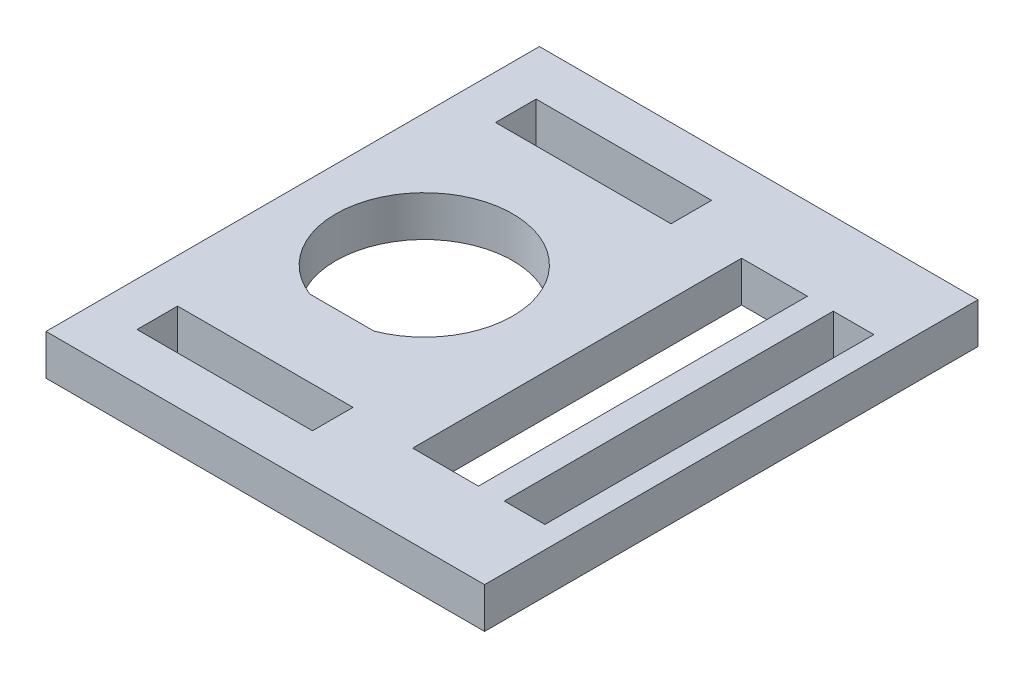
from build123d import *

# Parameters (mm, degrees)
SKETCH1_W           = 50.8
SKETCH1_H           = 57.15
BOSS_EXTRUDE1_DEPTH = 2.3495
CUT_EXTRUDE3_DEPTH  = 39.519751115
SKETCH5_W           = 4.699
SKETCH5_H           = 38.1
CUT_EXTRUDE4_DEPTH  = 39.519751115
SKETCH6_W           = 7.62
SKETCH6_H           = 38.1
CUT_EXTRUDE5_DEPTH  = 39.519751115
SKETCH7_W           = 20.32
SKETCH7_H           = 4.699
CUT_EXTRUDE6_DEPTH  = 39.519751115


with BuildPart() as part:
    # Sketch1 → Boss-Extrude1 (new, symmetric)
    with BuildSketch(Plane(origin=(0, 0, 0), x_dir=(1, 0, 0), z_dir=(0, 1, 0))):
        Rectangle(SKETCH1_W, SKETCH1_H)
    extrude(amount=BOSS_EXTRUDE1_DEPTH, both=True)

    # Sketch4 → Cut-Extrude3 (cut, through all)
    with BuildSketch(Plane(origin=(0, 2.3495, 0), x_dir=(1, 0, 0), z_dir=(0, 1, 0))):
        with BuildLine():
            Line((-13.882902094, -9.55), (-6.437097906, -9.55))
            ThreePointArc((-6.437097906, -9.55), (-10.16, 10.25), (-13.882902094, -9.55))
        make_face()
    extrude(amount=-CUT_EXTRUDE3_DEPTH, mode=Mode.SUBTRACT)

    # Sketch5 → Cut-Extrude4 (cut, through all)
    with BuildSketch(Plane.XZ.offset(2.3495)):
        with Locations((20.5105, 0)):
            Rectangle(SKETCH5_W, SKETCH5_H)
    extrude(amount=-CUT_EXTRUDE4_DEPTH, mode=Mode.SUBTRACT)

    # Sketch6 → Cut-Extrude5 (cut, through all)
    with BuildSketch(Plane(origin=(0, 2.3495, 0), x_dir=(1, 0, 0), z_dir=(0, 1, 0))):
        with Locations((11.351, 0)):
            Rectangle(SKETCH6_W, SKETCH6_H)
    extrude(amount=-CUT_EXTRUDE5_DEPTH, mode=Mode.SUBTRACT)

    # Sketch7 → Cut-Extrude6 (cut, through all)
    with BuildSketch(Plane(origin=(0, 2.3495, 0), x_dir=(1, 0, 0), z_dir=(0, 1, 0))):
        with Locations((-10.16, 20.7645)):
            Rectangle(SKETCH7_W, SKETCH7_H)
    cut_extrude6 = extrude(amount=-CUT_EXTRUDE6_DEPTH, mode=Mode.SUBTRACT)

    # Mirror1: Cut-Extrude6 across plane
    add(cut_extrude6.mirror(Plane.XY), mode=Mode.SUBTRACT)


solid = part.part
